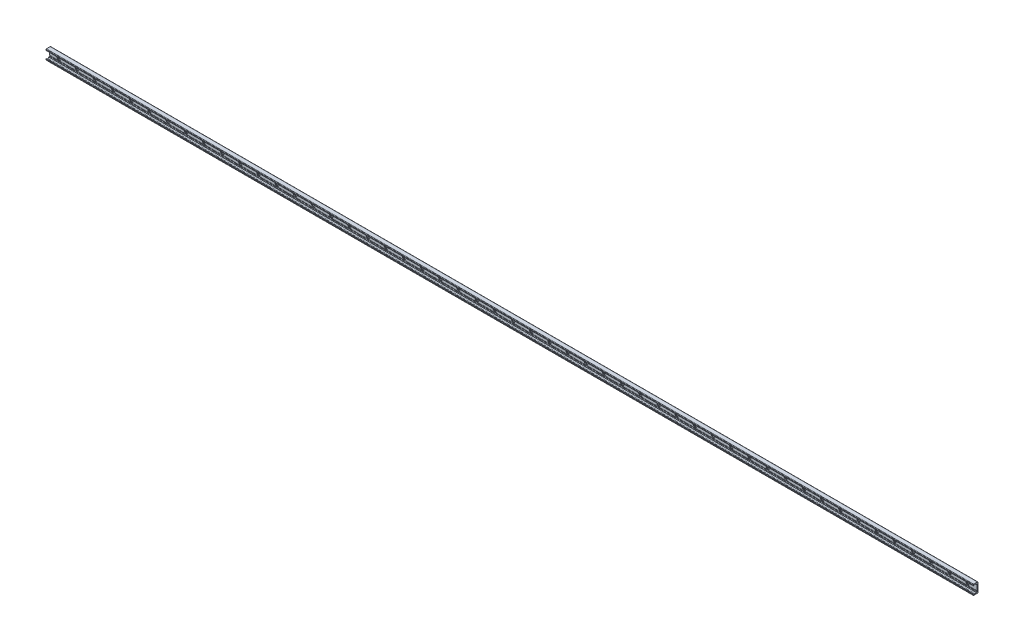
from build123d import *

# Parameters (mm, degrees)
BOSS_EXTRUDE1_DEPTH = 2040
SKETCH2_R           = 9
SKETCH2_R_2         = 4.5
CUT_EXTRUDE1_DEPTH  = 3.1
SKETCH2_2_R         = 4.5
CUT_EXTRUDE2_DEPTH  = 2041.180016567
LPATTERN1_COUNT     = 51
LPATTERN1_PITCH     = 80


with BuildPart() as part:
    # Sketch1 → Boss-Extrude1 (new, symmetric)
    with BuildSketch(Plane(origin=(0, 0, 0), x_dir=(0, 0, -1), z_dir=(1, 0, 0))):
        with BuildLine():
            Line((0, 0), (0, 19))
            ThreePointArc((0, 19), (-0.732233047, 20.767766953), (-2.5, 21.5))
            Line((-2.5, 21.5), (-19, 21.5))
            ThreePointArc((-19, 21.5), (-20.414213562, 20.914213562), (-21, 19.5))
            Line((-21, 19.5), (-21, 16.625057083))
            ThreePointArc((-21, 16.625057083), (-20.553251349, 15.888838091), (-19.693931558, 15.945160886))
            Line((-19.693931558, 15.945160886), (-16.794305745, 17.975500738))
            ThreePointArc((-16.794305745, 17.975500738), (-14.5, 18.69889256), (-12.205694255, 17.975500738))
            Line((-12.205694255, 17.975500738), (-8.829831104, 15.611695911))
            ThreePointArc((-8.829831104, 15.611695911), (-8.28408983, 15.342566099), (-7.682678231, 15.25))
            Line((-7.682678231, 15.25), (-6.5, 15.25))
            ThreePointArc((-6.5, 15.25), (-5.085786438, 14.664213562), (-4.5, 13.25))
            Line((-4.5, 13.25), (-4.5, -10.75))
            ThreePointArc((-4.5, -10.75), (-4.25, -11), (-4.5, -11.25))
            Line((-4.5, -11.25), (-4.5, -12.25))
            ThreePointArc((-4.5, -12.25), (-4.25, -12.5), (-4.5, -12.75))
            Line((-4.5, -12.75), (-4.5, -13.25))
            ThreePointArc((-4.5, -13.25), (-5.085786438, -14.664213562), (-6.5, -15.25))
            Line((-6.5, -15.25), (-7.682678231, -15.25))
            ThreePointArc((-7.682678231, -15.25), (-8.28408983, -15.342566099), (-8.829831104, -15.611695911))
            Line((-8.829831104, -15.611695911), (-12.205694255, -17.975500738))
            ThreePointArc((-12.205694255, -17.975500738), (-14.5, -18.69889256), (-16.794305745, -17.975500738))
            Line((-16.794305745, -17.975500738), (-19.693931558, -15.945160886))
            ThreePointArc((-19.693931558, -15.945160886), (-20.553251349, -15.888838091), (-21, -16.625057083))
            Line((-21, -16.625057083), (-21, -19.5))
            ThreePointArc((-21, -19.5), (-20.414213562, -20.914213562), (-19, -21.5))
            Line((-19, -21.5), (-2.5, -21.5))
            ThreePointArc((-2.5, -21.5), (-0.732233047, -20.767766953), (0, -19))
            Line((0, -19), (0, 0))
        make_face()
    extrude(amount=BOSS_EXTRUDE1_DEPTH, both=True)

    # Sketch2 → Cut-Extrude1 (cut)
    with BuildSketch(Plane.XY.offset(4.5)):
        with Locations((2000, 0)):
            Circle(SKETCH2_R)
        with Locations((2000, 0)):
            Circle(SKETCH2_R_2, mode=Mode.SUBTRACT)
    cut_extrude1 = extrude(amount=-CUT_EXTRUDE1_DEPTH, mode=Mode.SUBTRACT)

    # Sketch2_2 → Cut-Extrude2 (cut, through all)
    with BuildSketch(Plane.XY.offset(4.5)):
        with Locations((2000, 0)):
            Circle(SKETCH2_2_R)
    cut_extrude2 = extrude(amount=-CUT_EXTRUDE2_DEPTH, mode=Mode.SUBTRACT)

    # LPattern1: Cut-Extrude1, Cut-Extrude2 ×51
    with Locations(*[(-i * LPATTERN1_PITCH, 0, 0) for i in range(1, LPATTERN1_COUNT)]):
        add(cut_extrude1, mode=Mode.SUBTRACT)
        add(cut_extrude2, mode=Mode.SUBTRACT)


solid = part.part
